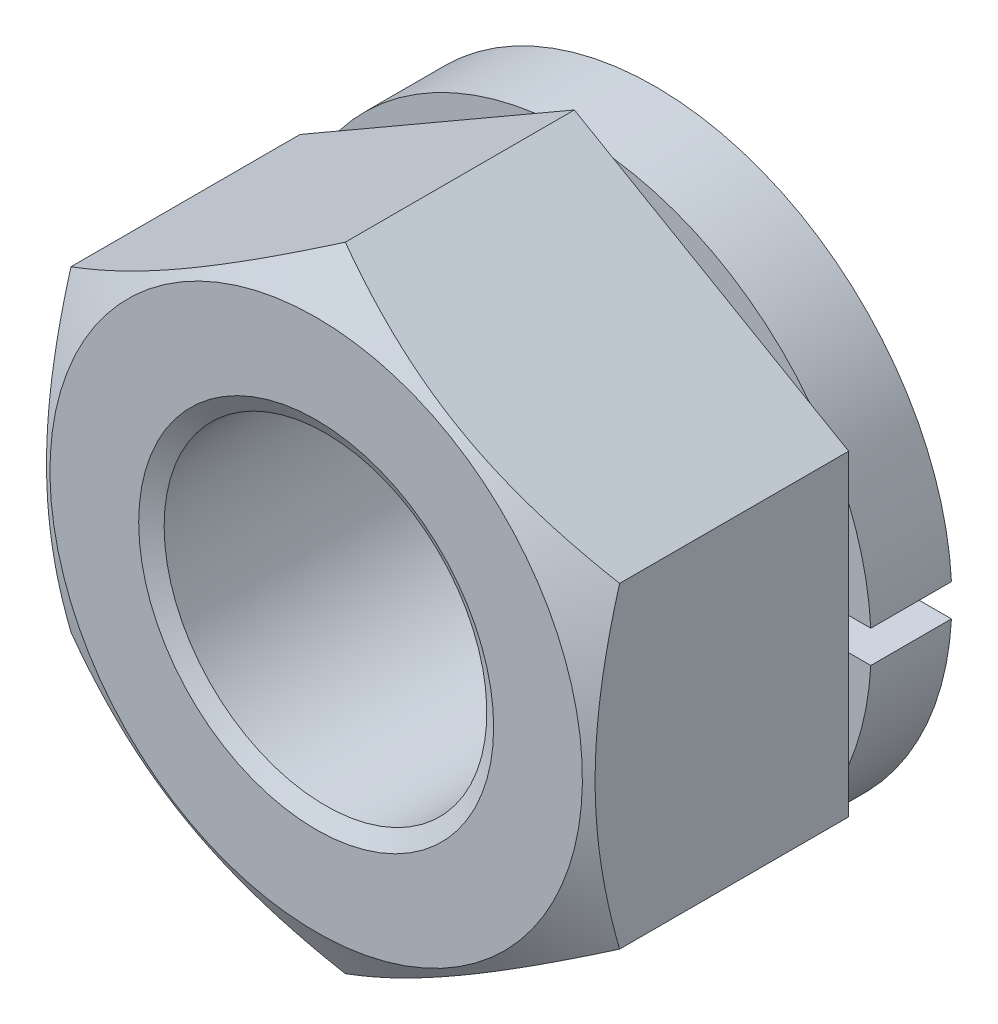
ISO-10303-21;
HEADER;
FILE_DESCRIPTION(('STEP AP214'),'2;1');
FILE_NAME('part.step','',(''),(''),'','','');
FILE_SCHEMA(('AUTOMOTIVE_DESIGN { 1 0 10303 214 1 1 1 1 }'));
ENDSEC;
DATA;
#1=APPLICATION_CONTEXT('core data for automotive mechanical design processes');
#2=APPLICATION_PROTOCOL_DEFINITION('international standard','automotive_design',2000,#1);
#3=PRODUCT_CONTEXT('',#1,'mechanical');
#4=PRODUCT('Part','Part','',(#3));
#5=PRODUCT_RELATED_PRODUCT_CATEGORY('part','',(#4));
#6=PRODUCT_DEFINITION_FORMATION('','',#4);
#7=PRODUCT_DEFINITION_CONTEXT('part definition',#1,'design');
#8=PRODUCT_DEFINITION('design','',#6,#7);
#9=PRODUCT_DEFINITION_SHAPE('','',#8);
#10=(LENGTH_UNIT() NAMED_UNIT(*) SI_UNIT(.MILLI.,.METRE.));
#11=(NAMED_UNIT(*) PLANE_ANGLE_UNIT() SI_UNIT($,.RADIAN.));
#12=(NAMED_UNIT(*) SI_UNIT($,.STERADIAN.) SOLID_ANGLE_UNIT());
#13=UNCERTAINTY_MEASURE_WITH_UNIT(LENGTH_MEASURE(1.E-05),#10,'distance_accuracy_value','');
#14=(GEOMETRIC_REPRESENTATION_CONTEXT(3) GLOBAL_UNCERTAINTY_ASSIGNED_CONTEXT((#13)) GLOBAL_UNIT_ASSIGNED_CONTEXT((#10,
#11,#12)) REPRESENTATION_CONTEXT('',''));
#15=CARTESIAN_POINT('',(0.,0.,0.));
#16=DIRECTION('',(0.,0.,1.));
#17=DIRECTION('',(1.,0.,0.));
#18=AXIS2_PLACEMENT_3D('',#15,#16,#17);
#19=CARTESIAN_POINT('',(8.5,-14.7224318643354,2.5));
#20=DIRECTION('',(0.,0.,1.));
#21=DIRECTION('',(0.,1.,0.));
#22=AXIS2_PLACEMENT_3D('',#19,#20,#21);
#23=PLANE('',#22);
#24=CARTESIAN_POINT('',(0.,0.,2.5));
#25=DIRECTION('',(0.,0.,-1.));
#26=DIRECTION('',(0.,1.,0.));
#27=AXIS2_PLACEMENT_3D('',#24,#25,#26);
#28=CIRCLE('',#27,9.2);
#29=CARTESIAN_POINT('',(8.5,-3.5199431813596,2.5));
#30=VERTEX_POINT('',#29);
#31=CARTESIAN_POINT('',(7.29836021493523,-5.60124434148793,2.5));
#32=VERTEX_POINT('',#31);
#33=EDGE_CURVE('E9',#30,#32,#28,.T.);
#34=ORIENTED_EDGE('',*,*,#33,.F.);
#35=DIRECTION('',(0.,1.,0.));
#36=VECTOR('',#35,1.);
#37=CARTESIAN_POINT('',(8.5,-4.90747728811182,2.5));
#38=LINE('',#37,#36);
#39=CARTESIAN_POINT('',(8.5,-4.90747728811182,2.5));
#40=VERTEX_POINT('',#39);
#41=EDGE_CURVE('E316',#40,#30,#38,.T.);
#42=ORIENTED_EDGE('',*,*,#41,.F.);
#43=DIRECTION('',(0.866025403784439,0.5,0.));
#44=VECTOR('',#43,1.);
#45=CARTESIAN_POINT('',(0.,-9.81495457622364,2.5));
#46=LINE('',#45,#44);
#47=EDGE_CURVE('E269',#32,#40,#46,.T.);
#48=ORIENTED_EDGE('',*,*,#47,.F.);
#49=EDGE_LOOP('',(#34,#42,#48));
#50=FACE_BOUND('',#49,.T.);
#51=ADVANCED_FACE('F14',(#50),#23,.F.);
#52=CARTESIAN_POINT('',(1.20163978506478,-9.12118752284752,2.5));
#53=VERTEX_POINT('',#52);
#54=CARTESIAN_POINT('',(-1.20163978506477,-9.12118752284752,2.5));
#55=VERTEX_POINT('',#54);
#56=EDGE_CURVE('E24',#53,#55,#28,.T.);
#57=ORIENTED_EDGE('',*,*,#56,.F.);
#58=CARTESIAN_POINT('',(0.,-9.81495457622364,2.5));
#59=VERTEX_POINT('',#58);
#60=EDGE_CURVE('E273',#59,#53,#46,.T.);
#61=ORIENTED_EDGE('',*,*,#60,.F.);
#62=DIRECTION('',(0.866025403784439,-0.5,0.));
#63=VECTOR('',#62,1.);
#64=CARTESIAN_POINT('',(-8.5,-4.90747728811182,2.5));
#65=LINE('',#64,#63);
#66=EDGE_CURVE('E253',#55,#59,#65,.T.);
#67=ORIENTED_EDGE('',*,*,#66,.F.);
#68=EDGE_LOOP('',(#57,#61,#67));
#69=FACE_BOUND('',#68,.T.);
#70=ADVANCED_FACE('F568',(#69),#23,.F.);
#71=CARTESIAN_POINT('',(-7.29836021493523,-5.60124434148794,2.5));
#72=VERTEX_POINT('',#71);
#73=CARTESIAN_POINT('',(-8.5,-3.5199431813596,2.5));
#74=VERTEX_POINT('',#73);
#75=EDGE_CURVE('E257',#72,#74,#28,.T.);
#76=ORIENTED_EDGE('',*,*,#75,.F.);
#77=CARTESIAN_POINT('',(-8.5,-4.90747728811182,2.5));
#78=VERTEX_POINT('',#77);
#79=EDGE_CURVE('E252',#78,#72,#65,.T.);
#80=ORIENTED_EDGE('',*,*,#79,.F.);
#81=DIRECTION('',(0.,-1.,0.));
#82=VECTOR('',#81,1.);
#83=CARTESIAN_POINT('',(-8.5,4.90747728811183,2.5));
#84=LINE('',#83,#82);
#85=EDGE_CURVE('E328',#74,#78,#84,.T.);
#86=ORIENTED_EDGE('',*,*,#85,.F.);
#87=EDGE_LOOP('',(#76,#80,#86));
#88=FACE_BOUND('',#87,.T.);
#89=ADVANCED_FACE('F562',(#88),#23,.F.);
#90=CARTESIAN_POINT('',(-8.5,3.51994318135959,2.5));
#91=VERTEX_POINT('',#90);
#92=CARTESIAN_POINT('',(-7.29836021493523,5.60124434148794,2.5));
#93=VERTEX_POINT('',#92);
#94=EDGE_CURVE('E103',#91,#93,#28,.T.);
#95=ORIENTED_EDGE('',*,*,#94,.F.);
#96=CARTESIAN_POINT('',(-8.5,4.90747728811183,2.5));
#97=VERTEX_POINT('',#96);
#98=EDGE_CURVE('E330',#97,#91,#84,.T.);
#99=ORIENTED_EDGE('',*,*,#98,.F.);
#100=DIRECTION('',(-0.866025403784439,-0.5,0.));
#101=VECTOR('',#100,1.);
#102=CARTESIAN_POINT('',(0.,9.81495457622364,2.5));
#103=LINE('',#102,#101);
#104=EDGE_CURVE('E323',#93,#97,#103,.T.);
#105=ORIENTED_EDGE('',*,*,#104,.F.);
#106=EDGE_LOOP('',(#95,#99,#105));
#107=FACE_BOUND('',#106,.T.);
#108=ADVANCED_FACE('F381',(#107),#23,.F.);
#109=CARTESIAN_POINT('',(-1.20163978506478,9.12118752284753,2.5));
#110=VERTEX_POINT('',#109);
#111=CARTESIAN_POINT('',(1.20163978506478,9.12118752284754,2.5));
#112=VERTEX_POINT('',#111);
#113=EDGE_CURVE('E98',#110,#112,#28,.T.);
#114=ORIENTED_EDGE('',*,*,#113,.F.);
#115=CARTESIAN_POINT('',(0.,9.81495457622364,2.5));
#116=VERTEX_POINT('',#115);
#117=EDGE_CURVE('E325',#116,#110,#103,.T.);
#118=ORIENTED_EDGE('',*,*,#117,.F.);
#119=DIRECTION('',(-0.866025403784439,0.5,0.));
#120=VECTOR('',#119,1.);
#121=CARTESIAN_POINT('',(8.5,4.90747728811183,2.5));
#122=LINE('',#121,#120);
#123=EDGE_CURVE('E319',#112,#116,#122,.T.);
#124=ORIENTED_EDGE('',*,*,#123,.F.);
#125=EDGE_LOOP('',(#114,#118,#124));
#126=FACE_BOUND('',#125,.T.);
#127=ADVANCED_FACE('F415',(#126),#23,.F.);
#128=CARTESIAN_POINT('',(7.29836021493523,5.60124434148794,2.5));
#129=VERTEX_POINT('',#128);
#130=CARTESIAN_POINT('',(8.5,3.5199431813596,2.5));
#131=VERTEX_POINT('',#130);
#132=EDGE_CURVE('E89',#129,#131,#28,.T.);
#133=ORIENTED_EDGE('',*,*,#132,.F.);
#134=CARTESIAN_POINT('',(8.5,4.90747728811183,2.5));
#135=VERTEX_POINT('',#134);
#136=EDGE_CURVE('E320',#135,#129,#122,.T.);
#137=ORIENTED_EDGE('',*,*,#136,.F.);
#138=EDGE_CURVE('E317',#131,#135,#38,.T.);
#139=ORIENTED_EDGE('',*,*,#138,.F.);
#140=EDGE_LOOP('',(#133,#137,#139));
#141=FACE_BOUND('',#140,.T.);
#142=ADVANCED_FACE('F354',(#141),#23,.F.);
#143=CARTESIAN_POINT('',(0.,0.,2.5));
#144=DIRECTION('',(0.,0.,1.));
#145=DIRECTION('',(-1.,0.,0.));
#146=AXIS2_PLACEMENT_3D('',#143,#144,#145);
#147=CIRCLE('',#146,5.);
#148=CARTESIAN_POINT('',(-5.,0.,2.5));
#149=VERTEX_POINT('',#148);
#150=EDGE_CURVE('E97',#149,#149,#147,.T.);
#151=ORIENTED_EDGE('',*,*,#150,.T.);
#152=EDGE_LOOP('',(#151));
#153=FACE_BOUND('',#152,.T.);
#154=DIRECTION('',(1.,0.,0.));
#155=VECTOR('',#154,1.);
#156=CARTESIAN_POINT('',(5.07543101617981,-0.5,2.5));
#157=LINE('',#156,#155);
#158=CARTESIAN_POINT('',(5.07543101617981,-0.5,2.5));
#159=VERTEX_POINT('',#158);
#160=CARTESIAN_POINT('',(8.5,-0.5,2.5));
#161=VERTEX_POINT('',#160);
#162=EDGE_CURVE('E34',#159,#161,#157,.T.);
#163=ORIENTED_EDGE('',*,*,#162,.F.);
#164=CARTESIAN_POINT('',(0.,0.,2.5));
#165=DIRECTION('',(0.,0.,1.));
#166=DIRECTION('',(0.,1.,0.));
#167=AXIS2_PLACEMENT_3D('',#164,#165,#166);
#168=CIRCLE('',#167,5.1);
#169=CARTESIAN_POINT('',(5.07543101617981,0.5,2.5));
#170=VERTEX_POINT('',#169);
#171=EDGE_CURVE('E104',#170,#159,#168,.T.);
#172=ORIENTED_EDGE('',*,*,#171,.F.);
#173=DIRECTION('',(-1.,0.,0.));
#174=VECTOR('',#173,1.);
#175=CARTESIAN_POINT('',(5.07543101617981,0.5,2.5));
#176=LINE('',#175,#174);
#177=CARTESIAN_POINT('',(8.5,0.5,2.5));
#178=VERTEX_POINT('',#177);
#179=EDGE_CURVE('E92',#178,#170,#176,.T.);
#180=ORIENTED_EDGE('',*,*,#179,.F.);
#181=EDGE_CURVE('E312',#161,#178,#38,.T.);
#182=ORIENTED_EDGE('',*,*,#181,.F.);
#183=EDGE_LOOP('',(#163,#172,#180,#182));
#184=FACE_BOUND('',#183,.T.);
#185=ADVANCED_FACE('F198',(#153,#184),#23,.F.);
#186=CARTESIAN_POINT('',(-8.5,-4.90747728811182,10.5));
#187=DIRECTION('',(0.5,0.866025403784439,0.));
#188=DIRECTION('',(-0.866025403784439,0.5,0.));
#189=AXIS2_PLACEMENT_3D('',#186,#187,#188);
#190=PLANE('',#189);
#191=CARTESIAN_POINT('',(-8.5002,-4.90736181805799,9.59640638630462));
#192=CARTESIAN_POINT('',(-8.31336077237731,-5.01523349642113,9.65867629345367));
#193=CARTESIAN_POINT('',(-8.1258249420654,-5.12350735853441,9.71812013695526));
#194=CARTESIAN_POINT('',(-7.74923024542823,-5.34093440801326,9.83057732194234));
#195=CARTESIAN_POINT('',(-7.56017075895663,-5.45008795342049,9.88358788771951));
#196=CARTESIAN_POINT('',(-6.9899652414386,-5.77929626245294,10.0319290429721));
#197=CARTESIAN_POINT('',(-6.60656835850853,-6.00065055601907,10.1163035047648));
#198=CARTESIAN_POINT('',(-6.03282233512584,-6.33190297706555,10.2152424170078));
#199=CARTESIAN_POINT('',(-5.84418723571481,-6.44081150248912,10.2434272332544));
#200=CARTESIAN_POINT('',(-5.46606397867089,-6.65912106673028,10.2906883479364));
#201=CARTESIAN_POINT('',(-5.27657589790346,-6.76852206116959,10.3097654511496));
#202=CARTESIAN_POINT('',(-4.8972734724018,-6.98751241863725,10.3383276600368));
#203=CARTESIAN_POINT('',(-4.70745974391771,-7.09710142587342,10.3478236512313));
#204=CARTESIAN_POINT('',(-4.32765694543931,-7.3163806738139,10.3570200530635));
#205=CARTESIAN_POINT('',(-4.13766788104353,-7.42607091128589,10.3567207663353));
#206=CARTESIAN_POINT('',(-3.78247698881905,-7.63114046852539,10.3470079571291));
#207=CARTESIAN_POINT('',(-3.6172500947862,-7.72653426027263,10.338779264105));
#208=CARTESIAN_POINT('',(-3.28718328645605,-7.9170984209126,10.3150731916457));
#209=CARTESIAN_POINT('',(-3.12234339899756,-8.01226877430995,10.2995953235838));
#210=CARTESIAN_POINT('',(-2.62846189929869,-8.29741139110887,10.2426538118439));
#211=CARTESIAN_POINT('',(-2.30029449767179,-8.48687892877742,10.190689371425));
#212=CARTESIAN_POINT('',(-1.64047857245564,-8.86782383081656,10.0607774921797));
#213=CARTESIAN_POINT('',(-1.30891425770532,-9.05925257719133,9.98227936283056));
#214=CARTESIAN_POINT('',(-0.650730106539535,-9.43925537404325,9.80412109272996));
#215=CARTESIAN_POINT('',(-0.324101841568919,-9.62783429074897,9.70450279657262));
#216=CARTESIAN_POINT('',(0.000200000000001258,-9.81507004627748,9.59640638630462));
#217=B_SPLINE_CURVE_WITH_KNOTS('',3,(#191,#192,#193,#194,#195,#196,#197,#198,#199,#200,#201,
#202,#203,#204,#205,#206,#207,#208,#209,#210,#211,#212,#213,#214,#215,#216),.UNSPECIFIED.,.F.,
.F.,(4,2,2,2,2,2,2,2,2,2,2,2,4),(0.,0.673596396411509,1.34748239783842,2.69805431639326,
3.356799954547,4.01548737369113,4.67342558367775,5.33134346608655,5.90409556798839,
6.47688628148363,7.62328361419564,8.79510569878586,9.9646274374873),.UNSPECIFIED.);
#218=CARTESIAN_POINT('',(-8.5,-4.90747728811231,9.59647305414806));
#219=VERTEX_POINT('',#218);
#220=CARTESIAN_POINT('',(0.,-9.81495457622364,9.59647305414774));
#221=VERTEX_POINT('',#220);
#222=EDGE_CURVE('E183',#219,#221,#217,.T.);
#223=ORIENTED_EDGE('',*,*,#222,.F.);
#224=DIRECTION('',(0.,0.,-1.));
#225=VECTOR('',#224,1.);
#226=CARTESIAN_POINT('',(-8.5,-4.90747728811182,10.5));
#227=LINE('',#226,#225);
#228=EDGE_CURVE('E266',#219,#78,#227,.T.);
#229=ORIENTED_EDGE('',*,*,#228,.T.);
#230=ORIENTED_EDGE('',*,*,#79,.T.);
#231=EDGE_CURVE('E242',#72,#55,#65,.T.);
#232=ORIENTED_EDGE('',*,*,#231,.T.);
#233=ORIENTED_EDGE('',*,*,#66,.T.);
#234=DIRECTION('',(0.,0.,-1.));
#235=VECTOR('',#234,1.);
#236=CARTESIAN_POINT('',(0.,-9.81495457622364,10.5));
#237=LINE('',#236,#235);
#238=EDGE_CURVE('E288',#221,#59,#237,.T.);
#239=ORIENTED_EDGE('',*,*,#238,.F.);
#240=EDGE_LOOP('',(#223,#229,#230,#232,#233,#239));
#241=FACE_BOUND('',#240,.T.);
#242=ADVANCED_FACE('F193',(#241),#190,.F.);
#243=CARTESIAN_POINT('',(0.,-9.81495457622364,10.5));
#244=DIRECTION('',(-0.5,0.866025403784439,0.));
#245=DIRECTION('',(-0.866025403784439,-0.5,0.));
#246=AXIS2_PLACEMENT_3D('',#243,#244,#245);
#247=PLANE('',#246);
#248=CARTESIAN_POINT('',(-0.000199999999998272,-9.81507004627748,9.59640638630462));
#249=CARTESIAN_POINT('',(0.186639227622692,-9.70719836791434,9.65867629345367));
#250=CARTESIAN_POINT('',(0.374175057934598,-9.59892450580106,9.71812013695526));
#251=CARTESIAN_POINT('',(0.750769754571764,-9.3814974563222,9.83057732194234));
#252=CARTESIAN_POINT('',(0.939829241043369,-9.27234391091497,9.88358788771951));
#253=CARTESIAN_POINT('',(1.5100347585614,-8.94313560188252,10.0319290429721));
#254=CARTESIAN_POINT('',(1.89343164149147,-8.72178130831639,10.1163035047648));
#255=CARTESIAN_POINT('',(2.46717766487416,-8.39052888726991,10.2152424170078));
#256=CARTESIAN_POINT('',(2.65581276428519,-8.28162036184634,10.2434272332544));
#257=CARTESIAN_POINT('',(3.03393602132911,-8.06331079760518,10.2906883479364));
#258=CARTESIAN_POINT('',(3.22342410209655,-7.95390980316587,10.3097654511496));
#259=CARTESIAN_POINT('',(3.60272652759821,-7.73491944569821,10.3383276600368));
#260=CARTESIAN_POINT('',(3.7925402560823,-7.62533043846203,10.3478236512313));
#261=CARTESIAN_POINT('',(4.17234305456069,-7.40605119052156,10.3570200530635));
#262=CARTESIAN_POINT('',(4.36233211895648,-7.29636095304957,10.3567207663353));
#263=CARTESIAN_POINT('',(4.71752301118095,-7.09129139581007,10.3470079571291));
#264=CARTESIAN_POINT('',(4.88274990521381,-6.99589760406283,10.338779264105));
#265=CARTESIAN_POINT('',(5.21281671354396,-6.80533344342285,10.3150731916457));
#266=CARTESIAN_POINT('',(5.37765660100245,-6.71016309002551,10.2995953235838));
#267=CARTESIAN_POINT('',(5.87153810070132,-6.42502047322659,10.2426538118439));
#268=CARTESIAN_POINT('',(6.19970550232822,-6.23555293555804,10.190689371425));
#269=CARTESIAN_POINT('',(6.85952142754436,-5.8546080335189,10.0607774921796));
#270=CARTESIAN_POINT('',(7.19108574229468,-5.66317928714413,9.98227936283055));
#271=CARTESIAN_POINT('',(7.84926989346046,-5.28317649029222,9.80412109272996));
#272=CARTESIAN_POINT('',(8.17589815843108,-5.09459757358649,9.70450279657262));
#273=CARTESIAN_POINT('',(8.5002,-4.90736181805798,9.59640638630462));
#274=B_SPLINE_CURVE_WITH_KNOTS('',3,(#248,#249,#250,#251,#252,#253,#254,#255,#256,#257,#258,
#259,#260,#261,#262,#263,#264,#265,#266,#267,#268,#269,#270,#271,#272,#273),.UNSPECIFIED.,.F.,
.F.,(4,2,2,2,2,2,2,2,2,2,2,2,4),(0.,0.673596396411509,1.34748239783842,2.69805431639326,
3.356799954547,4.01548737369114,4.67342558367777,5.33134346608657,5.90409556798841,
6.47688628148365,7.62328361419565,8.79510569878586,9.9646274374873),.UNSPECIFIED.);
#275=CARTESIAN_POINT('',(8.5,-4.90747728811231,9.59647305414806));
#276=VERTEX_POINT('',#275);
#277=EDGE_CURVE('E176',#221,#276,#274,.T.);
#278=ORIENTED_EDGE('',*,*,#277,.F.);
#279=ORIENTED_EDGE('',*,*,#238,.T.);
#280=ORIENTED_EDGE('',*,*,#60,.T.);
#281=EDGE_CURVE('E271',#53,#32,#46,.T.);
#282=ORIENTED_EDGE('',*,*,#281,.T.);
#283=ORIENTED_EDGE('',*,*,#47,.T.);
#284=DIRECTION('',(0.,0.,-1.));
#285=VECTOR('',#284,1.);
#286=CARTESIAN_POINT('',(8.5,-4.90747728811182,10.5));
#287=LINE('',#286,#285);
#288=EDGE_CURVE('E291',#276,#40,#287,.T.);
#289=ORIENTED_EDGE('',*,*,#288,.F.);
#290=EDGE_LOOP('',(#278,#279,#280,#282,#283,#289));
#291=FACE_BOUND('',#290,.T.);
#292=ADVANCED_FACE('F190',(#291),#247,.F.);
#293=CARTESIAN_POINT('',(8.5,-4.90747728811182,10.5));
#294=DIRECTION('',(-1.,0.,0.));
#295=DIRECTION('',(0.,-1.,0.));
#296=AXIS2_PLACEMENT_3D('',#293,#294,#295);
#297=PLANE('',#296);
#298=CARTESIAN_POINT('',(8.5,-13.3532123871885,6.12424334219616));
#299=CARTESIAN_POINT('',(8.5,-12.980491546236,6.30572777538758));
#300=CARTESIAN_POINT('',(8.5,-12.6069332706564,6.48552089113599));
#301=CARTESIAN_POINT('',(8.5,-11.8576971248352,6.84077657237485));
#302=CARTESIAN_POINT('',(8.5,-11.4820189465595,7.01623848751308));
#303=CARTESIAN_POINT('',(8.5,-10.7262434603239,7.36273035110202));
#304=CARTESIAN_POINT('',(8.5,-10.3461333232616,7.53373241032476));
#305=CARTESIAN_POINT('',(8.5,-9.582949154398,7.86896358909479));
#306=CARTESIAN_POINT('',(8.5,-9.1998752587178,8.03319301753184));
#307=CARTESIAN_POINT('',(8.5,-8.41714882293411,8.35850173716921));
#308=CARTESIAN_POINT('',(8.5,-8.01737345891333,8.51928709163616));
#309=CARTESIAN_POINT('',(8.5,-7.21321018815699,8.82909825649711));
#310=CARTESIAN_POINT('',(8.5,-6.80882177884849,8.97812277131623));
#311=CARTESIAN_POINT('',(8.5,-5.995487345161,9.26062461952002));
#312=CARTESIAN_POINT('',(8.5,-5.58655186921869,9.39413200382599));
#313=CARTESIAN_POINT('',(8.5,-4.76283133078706,9.64143042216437));
#314=CARTESIAN_POINT('',(8.5,-4.34804810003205,9.75522748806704));
#315=CARTESIAN_POINT('',(8.5,-3.5146652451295,9.95713727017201));
#316=CARTESIAN_POINT('',(8.5,-3.09610182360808,10.0453954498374));
#317=CARTESIAN_POINT('',(8.5,-2.46431176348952,10.1548976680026));
#318=CARTESIAN_POINT('',(8.5,-2.25304332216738,10.187585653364));
#319=CARTESIAN_POINT('',(8.5,-1.82939916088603,10.2446966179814));
#320=CARTESIAN_POINT('',(8.5,-1.61702355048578,10.2691203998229));
#321=CARTESIAN_POINT('',(8.5,-1.19429859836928,10.3089008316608));
#322=CARTESIAN_POINT('',(8.5,-0.983960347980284,10.3243748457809));
#323=CARTESIAN_POINT('',(8.5,-0.562817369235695,10.3464066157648));
#324=CARTESIAN_POINT('',(8.5,-0.352012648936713,10.3529645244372));
#325=CARTESIAN_POINT('',(8.5,0.0696854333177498,10.3570069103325));
#326=CARTESIAN_POINT('',(8.5,0.280578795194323,10.3544913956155));
#327=CARTESIAN_POINT('',(8.5,0.702067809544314,10.3404504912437));
#328=CARTESIAN_POINT('',(8.5,0.912663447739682,10.3289246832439));
#329=CARTESIAN_POINT('',(8.5,1.41368406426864,10.2910339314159));
#330=CARTESIAN_POINT('',(8.5,1.70381406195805,10.2606779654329));
#331=CARTESIAN_POINT('',(8.5,2.28201816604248,10.1844828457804));
#332=CARTESIAN_POINT('',(8.5,2.57009200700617,10.1386417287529));
#333=CARTESIAN_POINT('',(8.5,3.43084473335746,9.98031317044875));
#334=CARTESIAN_POINT('',(8.5,3.99975744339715,9.84704608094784));
#335=CARTESIAN_POINT('',(8.5,4.85068640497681,9.61469791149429));
#336=CARTESIAN_POINT('',(8.5,5.13708206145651,9.53072185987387));
#337=CARTESIAN_POINT('',(8.5,5.70709507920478,9.35373387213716));
#338=CARTESIAN_POINT('',(8.5,5.99071242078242,9.26072187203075));
#339=CARTESIAN_POINT('',(8.5,6.55525229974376,9.06718020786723));
#340=CARTESIAN_POINT('',(8.5,6.83617561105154,8.96665278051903));
#341=CARTESIAN_POINT('',(8.5,7.39567349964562,8.7592942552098));
#342=CARTESIAN_POINT('',(8.5,7.67424811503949,8.65246325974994));
#343=CARTESIAN_POINT('',(8.5,8.37015789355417,8.37798646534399));
#344=CARTESIAN_POINT('',(8.5,8.78616988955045,8.20699065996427));
#345=CARTESIAN_POINT('',(8.5,9.61430591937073,7.85580015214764));
#346=CARTESIAN_POINT('',(8.5,10.0264296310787,7.67560469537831));
#347=CARTESIAN_POINT('',(8.5,10.847582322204,7.30799828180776));
#348=CARTESIAN_POINT('',(8.5,11.2566103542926,7.12058521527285));
#349=CARTESIAN_POINT('',(8.5,12.0720108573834,6.7401152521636));
#350=CARTESIAN_POINT('',(8.5,12.4783834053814,6.5470585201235));
#351=CARTESIAN_POINT('',(8.5,13.2894902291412,6.15617112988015));
#352=CARTESIAN_POINT('',(8.5,13.694221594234,5.95833444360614));
#353=CARTESIAN_POINT('',(8.5,14.5018747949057,5.55900103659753));
#354=CARTESIAN_POINT('',(8.5,14.9047966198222,5.35750429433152));
#355=CARTESIAN_POINT('',(8.5,15.7090600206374,4.95155296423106));
#356=CARTESIAN_POINT('',(8.5,16.1104018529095,4.74709888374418));
#357=CARTESIAN_POINT('',(8.5,16.9118148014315,4.33571385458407));
#358=CARTESIAN_POINT('',(8.5,17.3118859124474,4.12878289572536));
#359=CARTESIAN_POINT('',(8.5,18.4358924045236,3.54373271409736));
#360=CARTESIAN_POINT('',(8.5,19.1586022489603,3.16325922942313));
#361=CARTESIAN_POINT('',(8.5,20.6014087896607,2.39732055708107));
#362=CARTESIAN_POINT('',(8.5,21.3215053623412,2.01185513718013));
#363=CARTESIAN_POINT('',(8.5,22.7575551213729,1.23828349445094));
#364=CARTESIAN_POINT('',(8.5,23.4735142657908,0.850188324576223));
#365=CARTESIAN_POINT('',(8.5,24.5462387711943,0.26587480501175));
#366=CARTESIAN_POINT('',(8.5,24.9035996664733,0.0707482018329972));
#367=CARTESIAN_POINT('',(8.5,25.6179653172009,-0.32015466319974));
#368=CARTESIAN_POINT('',(8.5,25.974970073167,-0.515930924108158));
#369=CARTESIAN_POINT('',(8.5,26.3318176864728,-0.711993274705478));
#370=B_SPLINE_CURVE_WITH_KNOTS('',3,(#298,#299,#300,#301,#302,#303,#304,#305,#306,#307,#308,
#309,#310,#311,#312,#313,#314,#315,#316,#317,#318,#319,#320,#321,#322,#323,#324,#325,#326,#327,
#328,#329,#330,#331,#332,#333,#334,#335,#336,#337,#338,#339,#340,#341,#342,#343,#344,#345,#346,
#347,#348,#349,#350,#351,#352,#353,#354,#355,#356,#357,#358,#359,#360,#361,#362,#363,#364,#365,
#366,#367,#368,#369),.UNSPECIFIED.,.F.,.F.,(4,2,2,2,2,2,2,2,2,2,2,2,2,2,2,2,2,2,2,2,2,2,2,2,2,2,
2,2,2,2,2,2,2,2,2,4),(0.,1.24368507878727,2.48755578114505,3.73791418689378,4.98821550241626,
6.280762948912,7.57345258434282,8.86359550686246,10.1533429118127,11.4355927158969,
12.0768034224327,12.7179518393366,13.3504898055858,13.9830169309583,14.615543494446,
15.2480994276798,16.1227499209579,16.9975113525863,18.7479255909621,19.6432065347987,
20.5384938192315,21.4335157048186,22.3285230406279,23.6777187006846,25.0270251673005,
26.3767290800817,27.726393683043,29.0778597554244,30.4293337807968,31.7805786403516,
33.1318290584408,35.5820289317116,38.0323432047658,40.4754749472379,41.6969615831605,
42.9184464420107),.UNSPECIFIED.);
#371=CARTESIAN_POINT('',(8.5,4.90747728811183,9.59647305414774));
#372=VERTEX_POINT('',#371);
#373=EDGE_CURVE('E169',#276,#372,#370,.T.);
#374=ORIENTED_EDGE('',*,*,#373,.F.);
#375=ORIENTED_EDGE('',*,*,#288,.T.);
#376=ORIENTED_EDGE('',*,*,#41,.T.);
#377=EDGE_CURVE('E88',#30,#161,#38,.T.);
#378=ORIENTED_EDGE('',*,*,#377,.T.);
#379=ORIENTED_EDGE('',*,*,#181,.T.);
#380=EDGE_CURVE('E314',#178,#131,#38,.T.);
#381=ORIENTED_EDGE('',*,*,#380,.T.);
#382=ORIENTED_EDGE('',*,*,#138,.T.);
#383=DIRECTION('',(0.,0.,-1.));
#384=VECTOR('',#383,1.);
#385=CARTESIAN_POINT('',(8.5,4.90747728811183,10.5));
#386=LINE('',#385,#384);
#387=EDGE_CURVE('E294',#372,#135,#386,.T.);
#388=ORIENTED_EDGE('',*,*,#387,.F.);
#389=EDGE_LOOP('',(#374,#375,#376,#378,#379,#381,#382,#388));
#390=FACE_BOUND('',#389,.T.);
#391=ADVANCED_FACE('F158',(#390),#297,.F.);
#392=CARTESIAN_POINT('',(8.5,4.90747728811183,10.5));
#393=DIRECTION('',(-0.5,-0.866025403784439,0.));
#394=DIRECTION('',(0.866025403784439,-0.5,0.));
#395=AXIS2_PLACEMENT_3D('',#392,#393,#394);
#396=PLANE('',#395);
#397=CARTESIAN_POINT('',(8.5002,4.90736181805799,9.59640638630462));
#398=CARTESIAN_POINT('',(8.31336077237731,5.01523349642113,9.65867629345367));
#399=CARTESIAN_POINT('',(8.1258249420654,5.12350735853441,9.71812013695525));
#400=CARTESIAN_POINT('',(7.74923024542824,5.34093440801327,9.83057732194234));
#401=CARTESIAN_POINT('',(7.56017075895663,5.4500879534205,9.88358788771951));
#402=CARTESIAN_POINT('',(6.9899652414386,5.77929626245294,10.0319290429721));
#403=CARTESIAN_POINT('',(6.60656835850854,6.00065055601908,10.1163035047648));
#404=CARTESIAN_POINT('',(6.03282233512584,6.33190297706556,10.2152424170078));
#405=CARTESIAN_POINT('',(5.84418723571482,6.44081150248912,10.2434272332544));
#406=CARTESIAN_POINT('',(5.46606397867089,6.65912106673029,10.2906883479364));
#407=CARTESIAN_POINT('',(5.27657589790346,6.7685220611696,10.3097654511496));
#408=CARTESIAN_POINT('',(4.8972734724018,6.98751241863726,10.3383276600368));
#409=CARTESIAN_POINT('',(4.70745974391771,7.09710142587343,10.3478236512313));
#410=CARTESIAN_POINT('',(4.32765694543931,7.31638067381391,10.3570200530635));
#411=CARTESIAN_POINT('',(4.13766788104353,7.4260709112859,10.3567207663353));
#412=CARTESIAN_POINT('',(3.78247698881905,7.6311404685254,10.3470079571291));
#413=CARTESIAN_POINT('',(3.6172500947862,7.72653426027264,10.338779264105));
#414=CARTESIAN_POINT('',(3.28718328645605,7.91709842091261,10.3150731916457));
#415=CARTESIAN_POINT('',(3.12234339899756,8.01226877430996,10.2995953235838));
#416=CARTESIAN_POINT('',(2.62846189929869,8.29741139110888,10.2426538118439));
#417=CARTESIAN_POINT('',(2.30029449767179,8.48687892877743,10.190689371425));
#418=CARTESIAN_POINT('',(1.64047857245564,8.86782383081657,10.0607774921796));
#419=CARTESIAN_POINT('',(1.30891425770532,9.05925257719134,9.98227936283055));
#420=CARTESIAN_POINT('',(0.650730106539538,9.43925537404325,9.80412109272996));
#421=CARTESIAN_POINT('',(0.324101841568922,9.62783429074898,9.70450279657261));
#422=CARTESIAN_POINT('',(-0.000200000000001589,9.81507004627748,9.59640638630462));
#423=B_SPLINE_CURVE_WITH_KNOTS('',3,(#397,#398,#399,#400,#401,#402,#403,#404,#405,#406,#407,
#408,#409,#410,#411,#412,#413,#414,#415,#416,#417,#418,#419,#420,#421,#422),.UNSPECIFIED.,.F.,
.F.,(4,2,2,2,2,2,2,2,2,2,2,2,4),(0.,0.673596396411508,1.34748239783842,2.69805431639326,
3.356799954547,4.01548737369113,4.67342558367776,5.33134346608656,5.9040955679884,
6.47688628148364,7.62328361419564,8.79510569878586,9.9646274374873),.UNSPECIFIED.);
#424=CARTESIAN_POINT('',(0.,9.81495457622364,9.59647305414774));
#425=VERTEX_POINT('',#424);
#426=EDGE_CURVE('E162',#372,#425,#423,.T.);
#427=ORIENTED_EDGE('',*,*,#426,.F.);
#428=ORIENTED_EDGE('',*,*,#387,.T.);
#429=ORIENTED_EDGE('',*,*,#136,.T.);
#430=EDGE_CURVE('E324',#129,#112,#122,.T.);
#431=ORIENTED_EDGE('',*,*,#430,.T.);
#432=ORIENTED_EDGE('',*,*,#123,.T.);
#433=DIRECTION('',(0.,0.,-1.));
#434=VECTOR('',#433,1.);
#435=CARTESIAN_POINT('',(0.,9.81495457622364,10.5));
#436=LINE('',#435,#434);
#437=EDGE_CURVE('E338',#425,#116,#436,.T.);
#438=ORIENTED_EDGE('',*,*,#437,.F.);
#439=EDGE_LOOP('',(#427,#428,#429,#431,#432,#438));
#440=FACE_BOUND('',#439,.T.);
#441=ADVANCED_FACE('F153',(#440),#396,.F.);
#442=CARTESIAN_POINT('',(0.,9.81495457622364,10.5));
#443=DIRECTION('',(0.5,-0.866025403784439,0.));
#444=DIRECTION('',(0.866025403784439,0.5,0.));
#445=AXIS2_PLACEMENT_3D('',#442,#443,#444);
#446=PLANE('',#445);
#447=CARTESIAN_POINT('',(0.000199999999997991,9.81507004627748,9.59640638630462));
#448=CARTESIAN_POINT('',(-0.186639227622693,9.70719836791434,9.65867629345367));
#449=CARTESIAN_POINT('',(-0.374175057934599,9.59892450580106,9.71812013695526));
#450=CARTESIAN_POINT('',(-0.750769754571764,9.3814974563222,9.83057732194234));
#451=CARTESIAN_POINT('',(-0.939829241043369,9.27234391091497,9.88358788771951));
#452=CARTESIAN_POINT('',(-1.5100347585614,8.94313560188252,10.0319290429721));
#453=CARTESIAN_POINT('',(-1.89343164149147,8.72178130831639,10.1163035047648));
#454=CARTESIAN_POINT('',(-2.46717766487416,8.39052888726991,10.2152424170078));
#455=CARTESIAN_POINT('',(-2.65581276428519,8.28162036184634,10.2434272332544));
#456=CARTESIAN_POINT('',(-3.03393602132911,8.06331079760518,10.2906883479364));
#457=CARTESIAN_POINT('',(-3.22342410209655,7.95390980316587,10.3097654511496));
#458=CARTESIAN_POINT('',(-3.60272652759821,7.73491944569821,10.3383276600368));
#459=CARTESIAN_POINT('',(-3.7925402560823,7.62533043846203,10.3478236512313));
#460=CARTESIAN_POINT('',(-4.17234305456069,7.40605119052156,10.3570200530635));
#461=CARTESIAN_POINT('',(-4.36233211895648,7.29636095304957,10.3567207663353));
#462=CARTESIAN_POINT('',(-4.71752301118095,7.09129139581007,10.3470079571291));
#463=CARTESIAN_POINT('',(-4.88274990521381,6.99589760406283,10.338779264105));
#464=CARTESIAN_POINT('',(-5.21281671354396,6.80533344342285,10.3150731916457));
#465=CARTESIAN_POINT('',(-5.37765660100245,6.71016309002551,10.2995953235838));
#466=CARTESIAN_POINT('',(-5.87153810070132,6.42502047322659,10.2426538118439));
#467=CARTESIAN_POINT('',(-6.19970550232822,6.23555293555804,10.190689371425));
#468=CARTESIAN_POINT('',(-6.85952142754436,5.8546080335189,10.0607774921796));
#469=CARTESIAN_POINT('',(-7.19108574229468,5.66317928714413,9.98227936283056));
#470=CARTESIAN_POINT('',(-7.84926989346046,5.28317649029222,9.80412109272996));
#471=CARTESIAN_POINT('',(-8.17589815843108,5.09459757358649,9.70450279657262));
#472=CARTESIAN_POINT('',(-8.5002,4.90736181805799,9.59640638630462));
#473=B_SPLINE_CURVE_WITH_KNOTS('',3,(#447,#448,#449,#450,#451,#452,#453,#454,#455,#456,#457,
#458,#459,#460,#461,#462,#463,#464,#465,#466,#467,#468,#469,#470,#471,#472),.UNSPECIFIED.,.F.,
.F.,(4,2,2,2,2,2,2,2,2,2,2,2,4),(0.,0.673596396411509,1.34748239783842,2.69805431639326,
3.356799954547,4.01548737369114,4.67342558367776,5.33134346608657,5.90409556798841,
6.47688628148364,7.62328361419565,8.79510569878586,9.9646274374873),.UNSPECIFIED.);
#474=CARTESIAN_POINT('',(-8.5,4.90747728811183,9.59647305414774));
#475=VERTEX_POINT('',#474);
#476=EDGE_CURVE('E132',#425,#475,#473,.T.);
#477=ORIENTED_EDGE('',*,*,#476,.F.);
#478=ORIENTED_EDGE('',*,*,#437,.T.);
#479=ORIENTED_EDGE('',*,*,#117,.T.);
#480=EDGE_CURVE('E329',#110,#93,#103,.T.);
#481=ORIENTED_EDGE('',*,*,#480,.T.);
#482=ORIENTED_EDGE('',*,*,#104,.T.);
#483=DIRECTION('',(0.,0.,-1.));
#484=VECTOR('',#483,1.);
#485=CARTESIAN_POINT('',(-8.5,4.90747728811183,10.5));
#486=LINE('',#485,#484);
#487=EDGE_CURVE('E335',#475,#97,#486,.T.);
#488=ORIENTED_EDGE('',*,*,#487,.F.);
#489=EDGE_LOOP('',(#477,#478,#479,#481,#482,#488));
#490=FACE_BOUND('',#489,.T.);
#491=ADVANCED_FACE('F147',(#490),#446,.F.);
#492=CARTESIAN_POINT('',(-8.5,4.90747728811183,10.5));
#493=DIRECTION('',(1.,0.,0.));
#494=DIRECTION('',(0.,1.,0.));
#495=AXIS2_PLACEMENT_3D('',#492,#493,#494);
#496=PLANE('',#495);
#497=CARTESIAN_POINT('',(-8.5,-13.3532123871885,6.12424334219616));
#498=CARTESIAN_POINT('',(-8.5,-12.980491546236,6.30572777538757));
#499=CARTESIAN_POINT('',(-8.49999999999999,-12.6069332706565,6.48552089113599));
#500=CARTESIAN_POINT('',(-8.49999999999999,-11.8576971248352,6.84077657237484));
#501=CARTESIAN_POINT('',(-8.5,-11.4820189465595,7.01623848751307));
#502=CARTESIAN_POINT('',(-8.5,-10.7262434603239,7.36273035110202));
#503=CARTESIAN_POINT('',(-8.5,-10.3461333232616,7.53373241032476));
#504=CARTESIAN_POINT('',(-8.5,-9.58294915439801,7.86896358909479));
#505=CARTESIAN_POINT('',(-8.5,-9.19987525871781,8.03319301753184));
#506=CARTESIAN_POINT('',(-8.5,-8.41714882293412,8.35850173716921));
#507=CARTESIAN_POINT('',(-8.5,-8.01737345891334,8.51928709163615));
#508=CARTESIAN_POINT('',(-8.5,-7.213210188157,8.82909825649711));
#509=CARTESIAN_POINT('',(-8.5,-6.8088217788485,8.97812277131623));
#510=CARTESIAN_POINT('',(-8.5,-5.99548734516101,9.26062461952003));
#511=CARTESIAN_POINT('',(-8.5,-5.58655186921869,9.39413200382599));
#512=CARTESIAN_POINT('',(-8.5,-4.76283133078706,9.64143042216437));
#513=CARTESIAN_POINT('',(-8.5,-4.34804810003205,9.75522748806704));
#514=CARTESIAN_POINT('',(-8.5,-3.5146652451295,9.95713727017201));
#515=CARTESIAN_POINT('',(-8.5,-3.09610182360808,10.0453954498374));
#516=CARTESIAN_POINT('',(-8.5,-2.46431176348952,10.1548976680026));
#517=CARTESIAN_POINT('',(-8.5,-2.25304332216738,10.187585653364));
#518=CARTESIAN_POINT('',(-8.5,-1.82939916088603,10.2446966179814));
#519=CARTESIAN_POINT('',(-8.5,-1.61702355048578,10.2691203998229));
#520=CARTESIAN_POINT('',(-8.5,-1.19429859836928,10.3089008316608));
#521=CARTESIAN_POINT('',(-8.5,-0.983960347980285,10.3243748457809));
#522=CARTESIAN_POINT('',(-8.5,-0.562817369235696,10.3464066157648));
#523=CARTESIAN_POINT('',(-8.5,-0.352012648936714,10.3529645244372));
#524=CARTESIAN_POINT('',(-8.5,0.0696854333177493,10.3570069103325));
#525=CARTESIAN_POINT('',(-8.5,0.280578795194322,10.3544913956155));
#526=CARTESIAN_POINT('',(-8.5,0.702067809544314,10.3404504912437));
#527=CARTESIAN_POINT('',(-8.5,0.912663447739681,10.3289246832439));
#528=CARTESIAN_POINT('',(-8.5,1.41368406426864,10.2910339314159));
#529=CARTESIAN_POINT('',(-8.5,1.70381406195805,10.2606779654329));
#530=CARTESIAN_POINT('',(-8.5,2.28201816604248,10.1844828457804));
#531=CARTESIAN_POINT('',(-8.5,2.57009200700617,10.1386417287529));
#532=CARTESIAN_POINT('',(-8.5,3.43084473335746,9.98031317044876));
#533=CARTESIAN_POINT('',(-8.5,3.99975744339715,9.84704608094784));
#534=CARTESIAN_POINT('',(-8.5,4.8506864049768,9.61469791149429));
#535=CARTESIAN_POINT('',(-8.5,5.13708206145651,9.53072185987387));
#536=CARTESIAN_POINT('',(-8.5,5.70709507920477,9.35373387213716));
#537=CARTESIAN_POINT('',(-8.5,5.99071242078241,9.26072187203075));
#538=CARTESIAN_POINT('',(-8.5,6.55525229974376,9.06718020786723));
#539=CARTESIAN_POINT('',(-8.5,6.83617561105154,8.96665278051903));
#540=CARTESIAN_POINT('',(-8.5,7.39567349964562,8.7592942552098));
#541=CARTESIAN_POINT('',(-8.5,7.67424811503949,8.65246325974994));
#542=CARTESIAN_POINT('',(-8.5,8.37015789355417,8.37798646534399));
#543=CARTESIAN_POINT('',(-8.5,8.78616988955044,8.20699065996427));
#544=CARTESIAN_POINT('',(-8.5,9.61430591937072,7.85580015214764));
#545=CARTESIAN_POINT('',(-8.5,10.0264296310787,7.67560469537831));
#546=CARTESIAN_POINT('',(-8.5,10.847582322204,7.30799828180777));
#547=CARTESIAN_POINT('',(-8.5,11.2566103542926,7.12058521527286));
#548=CARTESIAN_POINT('',(-8.5,12.0720108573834,6.7401152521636));
#549=CARTESIAN_POINT('',(-8.5,12.4783834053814,6.5470585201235));
#550=CARTESIAN_POINT('',(-8.5,13.2894902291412,6.15617112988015));
#551=CARTESIAN_POINT('',(-8.5,13.6942215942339,5.95833444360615));
#552=CARTESIAN_POINT('',(-8.5,14.5018747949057,5.55900103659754));
#553=CARTESIAN_POINT('',(-8.5,14.9047966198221,5.35750429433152));
#554=CARTESIAN_POINT('',(-8.5,15.7090600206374,4.95155296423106));
#555=CARTESIAN_POINT('',(-8.5,16.1104018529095,4.74709888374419));
#556=CARTESIAN_POINT('',(-8.5,16.9118148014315,4.33571385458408));
#557=CARTESIAN_POINT('',(-8.5,17.3118859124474,4.12878289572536));
#558=CARTESIAN_POINT('',(-8.5,18.4358924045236,3.54373271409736));
#559=CARTESIAN_POINT('',(-8.5,19.1586022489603,3.16325922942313));
#560=CARTESIAN_POINT('',(-8.5,20.6014087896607,2.39732055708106));
#561=CARTESIAN_POINT('',(-8.50000000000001,21.3215053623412,2.01185513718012));
#562=CARTESIAN_POINT('',(-8.50000000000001,22.7575551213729,1.23828349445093));
#563=CARTESIAN_POINT('',(-8.50000000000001,23.4735142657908,0.850188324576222));
#564=CARTESIAN_POINT('',(-8.50000000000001,24.5462387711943,0.265874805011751));
#565=CARTESIAN_POINT('',(-8.50000000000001,24.9035996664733,0.0707482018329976));
#566=CARTESIAN_POINT('',(-8.50000000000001,25.6179653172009,-0.32015466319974));
#567=CARTESIAN_POINT('',(-8.5,25.974970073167,-0.51593092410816));
#568=CARTESIAN_POINT('',(-8.5,26.3318176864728,-0.71199327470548));
#569=B_SPLINE_CURVE_WITH_KNOTS('',3,(#497,#498,#499,#500,#501,#502,#503,#504,#505,#506,#507,
#508,#509,#510,#511,#512,#513,#514,#515,#516,#517,#518,#519,#520,#521,#522,#523,#524,#525,#526,
#527,#528,#529,#530,#531,#532,#533,#534,#535,#536,#537,#538,#539,#540,#541,#542,#543,#544,#545,
#546,#547,#548,#549,#550,#551,#552,#553,#554,#555,#556,#557,#558,#559,#560,#561,#562,#563,#564,
#565,#566,#567,#568),.UNSPECIFIED.,.F.,.F.,(4,2,2,2,2,2,2,2,2,2,2,2,2,2,2,2,2,2,2,2,2,2,2,2,2,2,
2,2,2,2,2,2,2,2,2,4),(0.,1.24368507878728,2.48755578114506,3.73791418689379,4.98821550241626,
6.28076294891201,7.57345258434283,8.86359550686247,10.1533429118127,11.4355927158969,
12.0768034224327,12.7179518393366,13.3504898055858,13.9830169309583,14.615543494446,
15.2480994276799,16.1227499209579,16.9975113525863,18.7479255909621,19.6432065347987,
20.5384938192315,21.4335157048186,22.3285230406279,23.6777187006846,25.0270251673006,
26.3767290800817,27.726393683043,29.0778597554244,30.4293337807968,31.7805786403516,
33.1318290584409,35.5820289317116,38.0323432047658,40.4754749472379,41.6969615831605,
42.9184464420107),.UNSPECIFIED.);
#570=EDGE_CURVE('E120',#475,#219,#569,.F.);
#571=ORIENTED_EDGE('',*,*,#570,.F.);
#572=ORIENTED_EDGE('',*,*,#487,.T.);
#573=ORIENTED_EDGE('',*,*,#98,.T.);
#574=EDGE_CURVE('E333',#91,#74,#84,.T.);
#575=ORIENTED_EDGE('',*,*,#574,.T.);
#576=ORIENTED_EDGE('',*,*,#85,.T.);
#577=ORIENTED_EDGE('',*,*,#228,.F.);
#578=EDGE_LOOP('',(#571,#572,#573,#575,#576,#577));
#579=FACE_BOUND('',#578,.T.);
#580=ADVANCED_FACE('F143',(#579),#496,.F.);
#581=CARTESIAN_POINT('',(0.,0.,10.5));
#582=DIRECTION('',(0.,0.,-1.));
#583=DIRECTION('',(0.,-1.,0.));
#584=AXIS2_PLACEMENT_3D('',#581,#582,#583);
#585=CONICAL_SURFACE('',#584,8.25,1.0471975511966);
#586=CARTESIAN_POINT('',(0.,0.,10.5));
#587=DIRECTION('',(0.,0.,1.));
#588=DIRECTION('',(0.,1.,0.));
#589=AXIS2_PLACEMENT_3D('',#586,#587,#588);
#590=CIRCLE('',#589,8.25);
#591=CARTESIAN_POINT('',(0.,8.25,10.5));
#592=VERTEX_POINT('',#591);
#593=EDGE_CURVE('E115',#592,#592,#590,.T.);
#594=ORIENTED_EDGE('',*,*,#593,.F.);
#595=EDGE_LOOP('',(#594));
#596=FACE_BOUND('',#595,.T.);
#597=ORIENTED_EDGE('',*,*,#222,.T.);
#598=ORIENTED_EDGE('',*,*,#277,.T.);
#599=ORIENTED_EDGE('',*,*,#373,.T.);
#600=ORIENTED_EDGE('',*,*,#426,.T.);
#601=ORIENTED_EDGE('',*,*,#476,.T.);
#602=ORIENTED_EDGE('',*,*,#570,.T.);
#603=EDGE_LOOP('',(#597,#598,#599,#600,#601,#602));
#604=FACE_BOUND('',#603,.T.);
#605=ADVANCED_FACE('F139',(#596,#604),#585,.T.);
#606=CARTESIAN_POINT('',(8.5,-14.7224318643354,10.5));
#607=DIRECTION('',(0.,0.,1.));
#608=DIRECTION('',(0.,1.,0.));
#609=AXIS2_PLACEMENT_3D('',#606,#607,#608);
#610=PLANE('',#609);
#611=CARTESIAN_POINT('',(0.,0.,10.5));
#612=DIRECTION('',(0.,0.,1.));
#613=DIRECTION('',(0.,1.,0.));
#614=AXIS2_PLACEMENT_3D('',#611,#612,#613);
#615=CIRCLE('',#614,5.5);
#616=CARTESIAN_POINT('',(0.,5.5,10.5));
#617=VERTEX_POINT('',#616);
#618=EDGE_CURVE('E112',#617,#617,#615,.T.);
#619=ORIENTED_EDGE('',*,*,#618,.F.);
#620=EDGE_LOOP('',(#619));
#621=FACE_BOUND('',#620,.T.);
#622=ORIENTED_EDGE('',*,*,#593,.T.);
#623=EDGE_LOOP('',(#622));
#624=FACE_BOUND('',#623,.T.);
#625=ADVANCED_FACE('F149',(#621,#624),#610,.T.);
#626=CARTESIAN_POINT('',(0.,0.,10.5));
#627=DIRECTION('',(0.,0.,1.));
#628=DIRECTION('',(0.,1.,0.));
#629=AXIS2_PLACEMENT_3D('',#626,#627,#628);
#630=CONICAL_SURFACE('',#629,5.5,1.0471975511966);
#631=CARTESIAN_POINT('',(0.,0.,10.2113248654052));
#632=DIRECTION('',(0.,0.,1.));
#633=DIRECTION('',(-1.,0.,0.));
#634=AXIS2_PLACEMENT_3D('',#631,#632,#633);
#635=CIRCLE('',#634,5.);
#636=CARTESIAN_POINT('',(-5.,0.,10.2113248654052));
#637=VERTEX_POINT('',#636);
#638=EDGE_CURVE('E18',#637,#637,#635,.F.);
#639=ORIENTED_EDGE('',*,*,#638,.T.);
#640=EDGE_LOOP('',(#639));
#641=FACE_BOUND('',#640,.T.);
#642=ORIENTED_EDGE('',*,*,#618,.T.);
#643=EDGE_LOOP('',(#642));
#644=FACE_BOUND('',#643,.T.);
#645=ADVANCED_FACE('F226',(#641,#644),#630,.F.);
#646=CARTESIAN_POINT('',(0.,0.,2.5));
#647=DIRECTION('',(0.,0.,-1.));
#648=DIRECTION('',(0.,1.,0.));
#649=AXIS2_PLACEMENT_3D('',#646,#647,#648);
#650=PLANE('',#649);
#651=ORIENTED_EDGE('',*,*,#430,.F.);
#652=EDGE_CURVE('E96',#112,#129,#28,.T.);
#653=ORIENTED_EDGE('',*,*,#652,.F.);
#654=EDGE_LOOP('',(#651,#653));
#655=FACE_BOUND('',#654,.T.);
#656=ADVANCED_FACE('F361',(#655),#650,.F.);
#657=ORIENTED_EDGE('',*,*,#480,.F.);
#658=EDGE_CURVE('E366',#93,#110,#28,.T.);
#659=ORIENTED_EDGE('',*,*,#658,.F.);
#660=EDGE_LOOP('',(#657,#659));
#661=FACE_BOUND('',#660,.T.);
#662=ADVANCED_FACE('F236',(#661),#650,.F.);
#663=ORIENTED_EDGE('',*,*,#574,.F.);
#664=EDGE_CURVE('E260',#74,#91,#28,.T.);
#665=ORIENTED_EDGE('',*,*,#664,.F.);
#666=EDGE_LOOP('',(#663,#665));
#667=FACE_BOUND('',#666,.T.);
#668=ADVANCED_FACE('F230',(#667),#650,.F.);
#669=ORIENTED_EDGE('',*,*,#231,.F.);
#670=EDGE_CURVE('E94',#55,#72,#28,.T.);
#671=ORIENTED_EDGE('',*,*,#670,.F.);
#672=EDGE_LOOP('',(#669,#671));
#673=FACE_BOUND('',#672,.T.);
#674=ADVANCED_FACE('F208',(#673),#650,.F.);
#675=ORIENTED_EDGE('',*,*,#281,.F.);
#676=EDGE_CURVE('E26',#32,#53,#28,.T.);
#677=ORIENTED_EDGE('',*,*,#676,.F.);
#678=EDGE_LOOP('',(#675,#677));
#679=FACE_BOUND('',#678,.T.);
#680=ADVANCED_FACE('F205',(#679),#650,.F.);
#681=ORIENTED_EDGE('',*,*,#377,.F.);
#682=CARTESIAN_POINT('',(9.18640299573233,-0.5,2.5));
#683=VERTEX_POINT('',#682);
#684=EDGE_CURVE('E81',#683,#30,#28,.T.);
#685=ORIENTED_EDGE('',*,*,#684,.F.);
#686=EDGE_CURVE('E64',#161,#683,#157,.T.);
#687=ORIENTED_EDGE('',*,*,#686,.F.);
#688=EDGE_LOOP('',(#681,#685,#687));
#689=FACE_BOUND('',#688,.T.);
#690=ADVANCED_FACE('F87',(#689),#650,.F.);
#691=CARTESIAN_POINT('',(5.07543101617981,-0.5,0.));
#692=DIRECTION('',(0.,-1.,0.));
#693=DIRECTION('',(-1.,0.,0.));
#694=AXIS2_PLACEMENT_3D('',#691,#692,#693);
#695=PLANE('',#694);
#696=ORIENTED_EDGE('',*,*,#162,.T.);
#697=ORIENTED_EDGE('',*,*,#686,.T.);
#698=DIRECTION('',(0.,0.,1.));
#699=VECTOR('',#698,1.);
#700=CARTESIAN_POINT('',(9.18640299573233,-0.5,0.));
#701=LINE('',#700,#699);
#702=CARTESIAN_POINT('',(9.18640299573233,-0.5,0.));
#703=VERTEX_POINT('',#702);
#704=EDGE_CURVE('E68',#703,#683,#701,.T.);
#705=ORIENTED_EDGE('',*,*,#704,.F.);
#706=DIRECTION('',(1.,0.,0.));
#707=VECTOR('',#706,1.);
#708=CARTESIAN_POINT('',(5.07543101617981,-0.5,0.));
#709=LINE('',#708,#707);
#710=CARTESIAN_POINT('',(5.07543101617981,-0.5,0.));
#711=VERTEX_POINT('',#710);
#712=EDGE_CURVE('E85',#711,#703,#709,.T.);
#713=ORIENTED_EDGE('',*,*,#712,.F.);
#714=DIRECTION('',(0.,0.,1.));
#715=VECTOR('',#714,1.);
#716=CARTESIAN_POINT('',(5.07543101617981,-0.5,0.));
#717=LINE('',#716,#715);
#718=EDGE_CURVE('E84',#711,#159,#717,.T.);
#719=ORIENTED_EDGE('',*,*,#718,.T.);
#720=EDGE_LOOP('',(#696,#697,#705,#713,#719));
#721=FACE_BOUND('',#720,.T.);
#722=ADVANCED_FACE('F66',(#721),#695,.F.);
#723=CARTESIAN_POINT('',(0.,0.,0.));
#724=DIRECTION('',(0.,0.,1.));
#725=DIRECTION('',(0.,-1.,0.));
#726=AXIS2_PLACEMENT_3D('',#723,#724,#725);
#727=CYLINDRICAL_SURFACE('',#726,9.2);
#728=ORIENTED_EDGE('',*,*,#684,.T.);
#729=ORIENTED_EDGE('',*,*,#33,.T.);
#730=ORIENTED_EDGE('',*,*,#676,.T.);
#731=ORIENTED_EDGE('',*,*,#56,.T.);
#732=ORIENTED_EDGE('',*,*,#670,.T.);
#733=ORIENTED_EDGE('',*,*,#75,.T.);
#734=ORIENTED_EDGE('',*,*,#664,.T.);
#735=ORIENTED_EDGE('',*,*,#94,.T.);
#736=ORIENTED_EDGE('',*,*,#658,.T.);
#737=ORIENTED_EDGE('',*,*,#113,.T.);
#738=ORIENTED_EDGE('',*,*,#652,.T.);
#739=ORIENTED_EDGE('',*,*,#132,.T.);
#740=CARTESIAN_POINT('',(9.18640299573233,0.5,2.5));
#741=VERTEX_POINT('',#740);
#742=EDGE_CURVE('E58',#131,#741,#28,.T.);
#743=ORIENTED_EDGE('',*,*,#742,.T.);
#744=DIRECTION('',(0.,0.,1.));
#745=VECTOR('',#744,1.);
#746=CARTESIAN_POINT('',(9.18640299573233,0.5,0.));
#747=LINE('',#746,#745);
#748=CARTESIAN_POINT('',(9.18640299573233,0.5,0.));
#749=VERTEX_POINT('',#748);
#750=EDGE_CURVE('E110',#749,#741,#747,.T.);
#751=ORIENTED_EDGE('',*,*,#750,.F.);
#752=CARTESIAN_POINT('',(0.,0.,0.));
#753=DIRECTION('',(0.,0.,-1.));
#754=DIRECTION('',(0.,1.,0.));
#755=AXIS2_PLACEMENT_3D('',#752,#753,#754);
#756=CIRCLE('',#755,9.2);
#757=EDGE_CURVE('E76',#703,#749,#756,.T.);
#758=ORIENTED_EDGE('',*,*,#757,.F.);
#759=ORIENTED_EDGE('',*,*,#704,.T.);
#760=EDGE_LOOP('',(#728,#729,#730,#731,#732,#733,#734,#735,#736,#737,#738,#739,#743,#751,#758,#759));
#761=FACE_BOUND('',#760,.T.);
#762=ADVANCED_FACE('F16',(#761),#727,.T.);
#763=CARTESIAN_POINT('',(0.,0.,0.));
#764=DIRECTION('',(0.,0.,-1.));
#765=DIRECTION('',(0.,1.,0.));
#766=AXIS2_PLACEMENT_3D('',#763,#764,#765);
#767=PLANE('',#766);
#768=ORIENTED_EDGE('',*,*,#757,.T.);
#769=DIRECTION('',(-1.,0.,0.));
#770=VECTOR('',#769,1.);
#771=CARTESIAN_POINT('',(5.07543101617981,0.5,0.));
#772=LINE('',#771,#770);
#773=CARTESIAN_POINT('',(5.07543101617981,0.5,0.));
#774=VERTEX_POINT('',#773);
#775=EDGE_CURVE('E299',#749,#774,#772,.T.);
#776=ORIENTED_EDGE('',*,*,#775,.T.);
#777=CARTESIAN_POINT('',(0.,0.,0.));
#778=DIRECTION('',(0.,0.,1.));
#779=DIRECTION('',(0.,1.,0.));
#780=AXIS2_PLACEMENT_3D('',#777,#778,#779);
#781=CIRCLE('',#780,5.1);
#782=EDGE_CURVE('E301',#774,#711,#781,.T.);
#783=ORIENTED_EDGE('',*,*,#782,.T.);
#784=ORIENTED_EDGE('',*,*,#712,.T.);
#785=EDGE_LOOP('',(#768,#776,#783,#784));
#786=FACE_BOUND('',#785,.T.);
#787=ADVANCED_FACE('F200',(#786),#767,.T.);
#788=CARTESIAN_POINT('',(0.,0.,0.));
#789=DIRECTION('',(0.,0.,1.));
#790=DIRECTION('',(0.,-1.,0.));
#791=AXIS2_PLACEMENT_3D('',#788,#789,#790);
#792=CYLINDRICAL_SURFACE('',#791,5.1);
#793=ORIENTED_EDGE('',*,*,#171,.T.);
#794=ORIENTED_EDGE('',*,*,#718,.F.);
#795=ORIENTED_EDGE('',*,*,#782,.F.);
#796=DIRECTION('',(0.,0.,1.));
#797=VECTOR('',#796,1.);
#798=CARTESIAN_POINT('',(5.07543101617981,0.5,0.));
#799=LINE('',#798,#797);
#800=EDGE_CURVE('E108',#774,#170,#799,.T.);
#801=ORIENTED_EDGE('',*,*,#800,.T.);
#802=EDGE_LOOP('',(#793,#794,#795,#801));
#803=FACE_BOUND('',#802,.T.);
#804=ADVANCED_FACE('F203',(#803),#792,.F.);
#805=ORIENTED_EDGE('',*,*,#380,.F.);
#806=EDGE_CURVE('E77',#741,#178,#176,.T.);
#807=ORIENTED_EDGE('',*,*,#806,.F.);
#808=ORIENTED_EDGE('',*,*,#742,.F.);
#809=EDGE_LOOP('',(#805,#807,#808));
#810=FACE_BOUND('',#809,.T.);
#811=ADVANCED_FACE('F210',(#810),#650,.F.);
#812=CARTESIAN_POINT('',(5.07543101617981,0.5,0.));
#813=DIRECTION('',(0.,1.,0.));
#814=DIRECTION('',(1.,0.,0.));
#815=AXIS2_PLACEMENT_3D('',#812,#813,#814);
#816=PLANE('',#815);
#817=ORIENTED_EDGE('',*,*,#806,.T.);
#818=ORIENTED_EDGE('',*,*,#179,.T.);
#819=ORIENTED_EDGE('',*,*,#800,.F.);
#820=ORIENTED_EDGE('',*,*,#775,.F.);
#821=ORIENTED_EDGE('',*,*,#750,.T.);
#822=EDGE_LOOP('',(#817,#818,#819,#820,#821));
#823=FACE_BOUND('',#822,.T.);
#824=ADVANCED_FACE('F215',(#823),#816,.F.);
#825=CARTESIAN_POINT('',(0.,0.,0.5));
#826=DIRECTION('',(0.,0.,1.));
#827=DIRECTION('',(-1.,0.,0.));
#828=AXIS2_PLACEMENT_3D('',#825,#826,#827);
#829=CYLINDRICAL_SURFACE('',#828,5.);
#830=ORIENTED_EDGE('',*,*,#638,.F.);
#831=EDGE_LOOP('',(#830));
#832=FACE_BOUND('',#831,.T.);
#833=ORIENTED_EDGE('',*,*,#150,.F.);
#834=EDGE_LOOP('',(#833));
#835=FACE_BOUND('',#834,.T.);
#836=ADVANCED_FACE('F217',(#832,#835),#829,.F.);
#837=CLOSED_SHELL('',(#51,#70,#89,#108,#127,#142,#185,#242,#292,#391,#441,#491,#580,#605,#625,
#645,#656,#662,#668,#674,#680,#690,#722,#762,#787,#804,#811,#824,#836));
#838=MANIFOLD_SOLID_BREP('B1',#837);
#839=ADVANCED_BREP_SHAPE_REPRESENTATION('',(#18,#838),#14);
#840=SHAPE_DEFINITION_REPRESENTATION(#9,#839);
ENDSEC;
END-ISO-10303-21;
